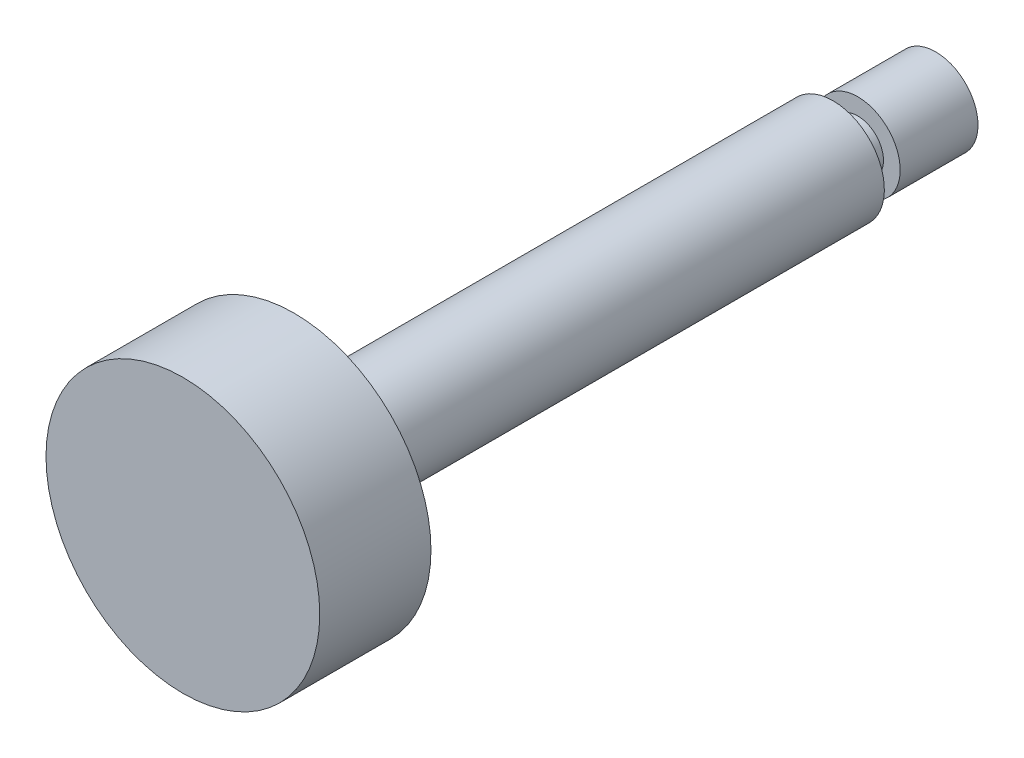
ISO-10303-21;
HEADER;
FILE_DESCRIPTION(('STEP AP214'),'2;1');
FILE_NAME('part.step','',(''),(''),'','','');
FILE_SCHEMA(('AUTOMOTIVE_DESIGN { 1 0 10303 214 1 1 1 1 }'));
ENDSEC;
DATA;
#1=APPLICATION_CONTEXT('core data for automotive mechanical design processes');
#2=APPLICATION_PROTOCOL_DEFINITION('international standard','automotive_design',2000,#1);
#3=PRODUCT_CONTEXT('',#1,'mechanical');
#4=PRODUCT('Part','Part','',(#3));
#5=PRODUCT_RELATED_PRODUCT_CATEGORY('part','',(#4));
#6=PRODUCT_DEFINITION_FORMATION('','',#4);
#7=PRODUCT_DEFINITION_CONTEXT('part definition',#1,'design');
#8=PRODUCT_DEFINITION('design','',#6,#7);
#9=PRODUCT_DEFINITION_SHAPE('','',#8);
#10=(LENGTH_UNIT() NAMED_UNIT(*) SI_UNIT(.MILLI.,.METRE.));
#11=(NAMED_UNIT(*) PLANE_ANGLE_UNIT() SI_UNIT($,.RADIAN.));
#12=(NAMED_UNIT(*) SI_UNIT($,.STERADIAN.) SOLID_ANGLE_UNIT());
#13=UNCERTAINTY_MEASURE_WITH_UNIT(LENGTH_MEASURE(1.E-05),#10,'distance_accuracy_value','');
#14=(GEOMETRIC_REPRESENTATION_CONTEXT(3) GLOBAL_UNCERTAINTY_ASSIGNED_CONTEXT((#13)) GLOBAL_UNIT_ASSIGNED_CONTEXT((#10,
#11,#12)) REPRESENTATION_CONTEXT('',''));
#15=CARTESIAN_POINT('',(0.,0.,0.));
#16=DIRECTION('',(0.,0.,1.));
#17=DIRECTION('',(1.,0.,0.));
#18=AXIS2_PLACEMENT_3D('',#15,#16,#17);
#19=CARTESIAN_POINT('',(0.,-6.,12.));
#20=DIRECTION('',(0.,0.,-1.));
#21=DIRECTION('',(0.,-1.,0.));
#22=AXIS2_PLACEMENT_3D('',#19,#20,#21);
#23=PLANE('',#22);
#24=CARTESIAN_POINT('',(0.,0.,12.));
#25=DIRECTION('',(0.,0.,1.));
#26=DIRECTION('',(0.,1.,0.));
#27=AXIS2_PLACEMENT_3D('',#24,#25,#26);
#28=CIRCLE('',#27,3.);
#29=CARTESIAN_POINT('',(0.,3.,12.));
#30=VERTEX_POINT('',#29);
#31=EDGE_CURVE('E40',#30,#30,#28,.T.);
#32=ORIENTED_EDGE('',*,*,#31,.T.);
#33=EDGE_LOOP('',(#32));
#34=FACE_BOUND('',#33,.T.);
#35=CARTESIAN_POINT('',(0.,0.,12.));
#36=DIRECTION('',(0.,0.,1.));
#37=DIRECTION('',(0.,1.,0.));
#38=AXIS2_PLACEMENT_3D('',#35,#36,#37);
#39=CIRCLE('',#38,6.);
#40=CARTESIAN_POINT('',(0.,6.,12.));
#41=VERTEX_POINT('',#40);
#42=EDGE_CURVE('E8',#41,#41,#39,.T.);
#43=ORIENTED_EDGE('',*,*,#42,.F.);
#44=EDGE_LOOP('',(#43));
#45=FACE_BOUND('',#44,.T.);
#46=ADVANCED_FACE('F12',(#34,#45),#23,.T.);
#47=CARTESIAN_POINT('',(0.,0.,20.));
#48=DIRECTION('',(0.,0.,1.));
#49=DIRECTION('',(0.,1.,0.));
#50=AXIS2_PLACEMENT_3D('',#47,#48,#49);
#51=CYLINDRICAL_SURFACE('',#50,6.);
#52=CARTESIAN_POINT('',(0.,0.,75.));
#53=DIRECTION('',(0.,0.,1.));
#54=DIRECTION('',(0.,1.,0.));
#55=AXIS2_PLACEMENT_3D('',#52,#53,#54);
#56=CIRCLE('',#55,6.);
#57=CARTESIAN_POINT('',(0.,6.,75.));
#58=VERTEX_POINT('',#57);
#59=EDGE_CURVE('E18',#58,#58,#56,.T.);
#60=ORIENTED_EDGE('',*,*,#59,.F.);
#61=EDGE_LOOP('',(#60));
#62=FACE_BOUND('',#61,.T.);
#63=ORIENTED_EDGE('',*,*,#42,.T.);
#64=EDGE_LOOP('',(#63));
#65=FACE_BOUND('',#64,.T.);
#66=ADVANCED_FACE('F59',(#62,#65),#51,.T.);
#67=CARTESIAN_POINT('',(0.,-16.,75.));
#68=DIRECTION('',(0.,0.,-1.));
#69=DIRECTION('',(0.,-1.,0.));
#70=AXIS2_PLACEMENT_3D('',#67,#68,#69);
#71=PLANE('',#70);
#72=ORIENTED_EDGE('',*,*,#59,.T.);
#73=EDGE_LOOP('',(#72));
#74=FACE_BOUND('',#73,.T.);
#75=CARTESIAN_POINT('',(0.,0.,75.));
#76=DIRECTION('',(0.,0.,1.));
#77=DIRECTION('',(0.,1.,0.));
#78=AXIS2_PLACEMENT_3D('',#75,#76,#77);
#79=CIRCLE('',#78,16.);
#80=CARTESIAN_POINT('',(0.,16.,75.));
#81=VERTEX_POINT('',#80);
#82=EDGE_CURVE('E22',#81,#81,#79,.T.);
#83=ORIENTED_EDGE('',*,*,#82,.F.);
#84=EDGE_LOOP('',(#83));
#85=FACE_BOUND('',#84,.T.);
#86=ADVANCED_FACE('F63',(#74,#85),#71,.T.);
#87=CARTESIAN_POINT('',(0.,0.,20.));
#88=DIRECTION('',(0.,0.,1.));
#89=DIRECTION('',(0.,1.,0.));
#90=AXIS2_PLACEMENT_3D('',#87,#88,#89);
#91=CYLINDRICAL_SURFACE('',#90,16.);
#92=CARTESIAN_POINT('',(0.,0.,88.));
#93=DIRECTION('',(0.,0.,1.));
#94=DIRECTION('',(0.,1.,0.));
#95=AXIS2_PLACEMENT_3D('',#92,#93,#94);
#96=CIRCLE('',#95,16.);
#97=CARTESIAN_POINT('',(0.,16.,88.));
#98=VERTEX_POINT('',#97);
#99=EDGE_CURVE('E26',#98,#98,#96,.T.);
#100=ORIENTED_EDGE('',*,*,#99,.F.);
#101=EDGE_LOOP('',(#100));
#102=FACE_BOUND('',#101,.T.);
#103=ORIENTED_EDGE('',*,*,#82,.T.);
#104=EDGE_LOOP('',(#103));
#105=FACE_BOUND('',#104,.T.);
#106=ADVANCED_FACE('F68',(#102,#105),#91,.T.);
#107=CARTESIAN_POINT('',(0.,-16.,88.));
#108=DIRECTION('',(0.,0.,-1.));
#109=DIRECTION('',(0.,-1.,0.));
#110=AXIS2_PLACEMENT_3D('',#107,#108,#109);
#111=PLANE('',#110);
#112=ORIENTED_EDGE('',*,*,#99,.T.);
#113=EDGE_LOOP('',(#112));
#114=FACE_BOUND('',#113,.T.);
#115=ADVANCED_FACE('F73',(#114),#111,.F.);
#116=CARTESIAN_POINT('',(0.,-4.95,0.));
#117=DIRECTION('',(0.,0.,-1.));
#118=DIRECTION('',(0.,-1.,0.));
#119=AXIS2_PLACEMENT_3D('',#116,#117,#118);
#120=PLANE('',#119);
#121=CARTESIAN_POINT('',(0.,0.,0.));
#122=DIRECTION('',(0.,0.,1.));
#123=DIRECTION('',(0.,1.,0.));
#124=AXIS2_PLACEMENT_3D('',#121,#122,#123);
#125=CIRCLE('',#124,4.95);
#126=CARTESIAN_POINT('',(0.,4.95,0.));
#127=VERTEX_POINT('',#126);
#128=EDGE_CURVE('E31',#127,#127,#125,.T.);
#129=ORIENTED_EDGE('',*,*,#128,.F.);
#130=EDGE_LOOP('',(#129));
#131=FACE_BOUND('',#130,.T.);
#132=ADVANCED_FACE('F77',(#131),#120,.T.);
#133=CARTESIAN_POINT('',(0.,0.,20.));
#134=DIRECTION('',(0.,0.,1.));
#135=DIRECTION('',(0.,1.,0.));
#136=AXIS2_PLACEMENT_3D('',#133,#134,#135);
#137=CYLINDRICAL_SURFACE('',#136,4.95);
#138=ORIENTED_EDGE('',*,*,#128,.T.);
#139=EDGE_LOOP('',(#138));
#140=FACE_BOUND('',#139,.T.);
#141=CARTESIAN_POINT('',(0.,0.,9.1));
#142=DIRECTION('',(0.,0.,1.));
#143=DIRECTION('',(0.,1.,0.));
#144=AXIS2_PLACEMENT_3D('',#141,#142,#143);
#145=CIRCLE('',#144,4.95);
#146=CARTESIAN_POINT('',(0.,4.95,9.1));
#147=VERTEX_POINT('',#146);
#148=EDGE_CURVE('E34',#147,#147,#145,.T.);
#149=ORIENTED_EDGE('',*,*,#148,.F.);
#150=EDGE_LOOP('',(#149));
#151=FACE_BOUND('',#150,.T.);
#152=ADVANCED_FACE('F55',(#140,#151),#137,.T.);
#153=CARTESIAN_POINT('',(0.,-3.,9.1));
#154=DIRECTION('',(0.,0.,1.));
#155=DIRECTION('',(0.,1.,0.));
#156=AXIS2_PLACEMENT_3D('',#153,#154,#155);
#157=PLANE('',#156);
#158=ORIENTED_EDGE('',*,*,#148,.T.);
#159=EDGE_LOOP('',(#158));
#160=FACE_BOUND('',#159,.T.);
#161=CARTESIAN_POINT('',(0.,0.,9.1));
#162=DIRECTION('',(0.,0.,1.));
#163=DIRECTION('',(0.,1.,0.));
#164=AXIS2_PLACEMENT_3D('',#161,#162,#163);
#165=CIRCLE('',#164,3.);
#166=CARTESIAN_POINT('',(0.,3.,9.1));
#167=VERTEX_POINT('',#166);
#168=EDGE_CURVE('E37',#167,#167,#165,.T.);
#169=ORIENTED_EDGE('',*,*,#168,.F.);
#170=EDGE_LOOP('',(#169));
#171=FACE_BOUND('',#170,.T.);
#172=ADVANCED_FACE('F48',(#160,#171),#157,.T.);
#173=CARTESIAN_POINT('',(0.,0.,20.));
#174=DIRECTION('',(0.,0.,1.));
#175=DIRECTION('',(0.,1.,0.));
#176=AXIS2_PLACEMENT_3D('',#173,#174,#175);
#177=CYLINDRICAL_SURFACE('',#176,3.);
#178=ORIENTED_EDGE('',*,*,#168,.T.);
#179=EDGE_LOOP('',(#178));
#180=FACE_BOUND('',#179,.T.);
#181=ORIENTED_EDGE('',*,*,#31,.F.);
#182=EDGE_LOOP('',(#181));
#183=FACE_BOUND('',#182,.T.);
#184=ADVANCED_FACE('F46',(#180,#183),#177,.T.);
#185=CLOSED_SHELL('',(#46,#66,#86,#106,#115,#132,#152,#172,#184));
#186=MANIFOLD_SOLID_BREP('B1',#185);
#187=ADVANCED_BREP_SHAPE_REPRESENTATION('',(#18,#186),#14);
#188=SHAPE_DEFINITION_REPRESENTATION(#9,#187);
ENDSEC;
END-ISO-10303-21;
